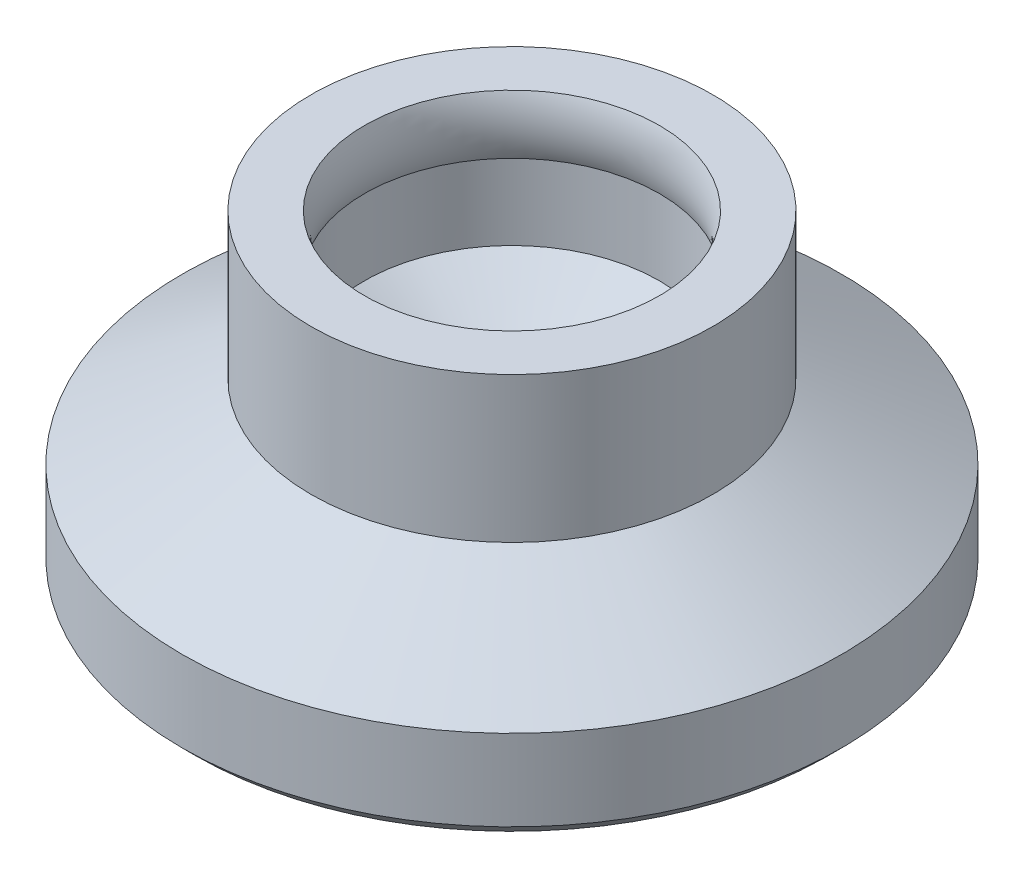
from build123d import *

# Parameters (mm, degrees)
SKETCH1_R      = 6.4
EXTRUDE1_DEPTH = 5
SKETCH3_R      = 10.5
EXTRUDE2_DEPTH = 3
CHAMFER1_SIZE  = 0.42


with BuildPart() as part:
    # Sketch1 → Extrude1 (new, symmetric)
    with BuildSketch(Plane(origin=(0, 0, 0), x_dir=(1, 0, 0), z_dir=(0, 1, 0))):
        with Locations(Location((0, 0, 0), (0, 0, 270))):
            Circle(SKETCH1_R)
    extrude(amount=EXTRUDE1_DEPTH, both=True)

    # Sketch3 → Extrude2 (add)
    with BuildSketch(Plane.XZ.offset(5)):
        with Locations(Location((0, 0, 0), (0, 0, 270))):
            Circle(SKETCH3_R)
    extrude(amount=-EXTRUDE2_DEPTH)

    # Sketch4 → Revolve1 (revolve)
    with BuildSketch(Plane.XY, mode=Mode.PRIVATE) as revolve1_sk:
        Polygon((-10.5, -2), (-6.4, 0.367136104), (-6.4, -2), align=None)
    revolve(revolve1_sk.sketch.rotate(Axis((0, 5, 0), (0, -1, 0)), 270), axis=Axis((0, 5, 0), (0, -1, 0)))

    # Chamfer1
    chamfer1_edges = [part.edges().sort_by_distance(p)[0] for p in [
        (0, -5, 10.5),
    ]]
    chamfer(chamfer1_edges, length=CHAMFER1_SIZE)

    # Sketch5 → Cut-Revolve1 (revolve, cut)
    with BuildSketch(Plane.XY, mode=Mode.PRIVATE) as cut_revolve1_sk:
        with BuildLine():
            Line((0, 5), (4.7, 5))
            ThreePointArc((4.7, 5), (4.512, 4.06), (4.7, 3.12))
            Line((4.7, 3.12), (4.7, 0.713546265))
            Line((4.7, 0.713546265), (0, -2))
            Line((0, -2), (0, 5))
        make_face()
    revolve(cut_revolve1_sk.sketch.rotate(Axis((0, 0, 0), (0, 1, 0)), 270), axis=Axis((0, 0, 0), (0, 1, 0)), mode=Mode.SUBTRACT)


solid = part.part
